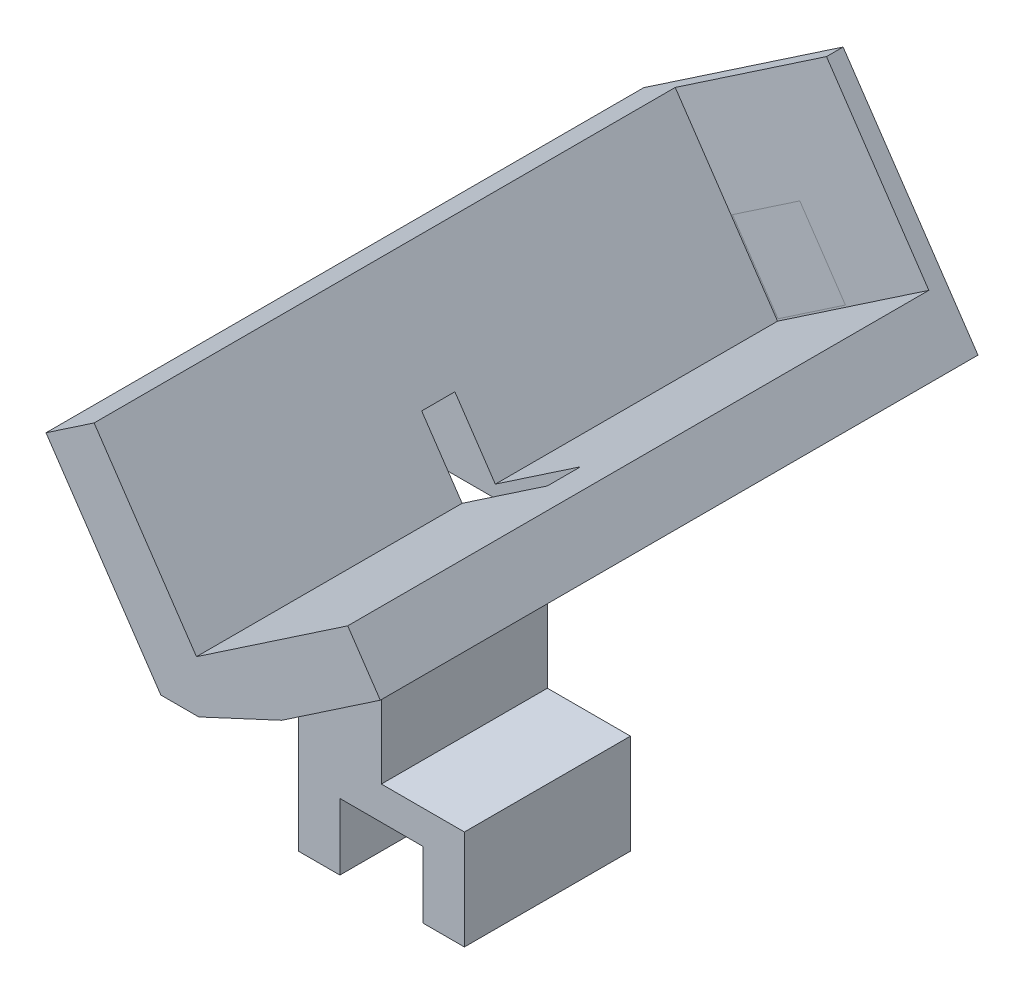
from build123d import *

# Parameters (mm, degrees)
EXTRUDE1_DEPTH      = 10
EXTRUDE2_DEPTH      = 10
EXTRUDE3_DEPTH      = 20
EXTRUDE3_DEPTH_BACK = 16
SKETCH5_W           = 12.517816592
SKETCH5_H           = 10.675390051
EXTRUDE5_DEPTH      = 2
SKETCH6_R           = 0.5
EXTRUDE6_DEPTH      = 1
EXTRUDE7_DEPTH      = 1
SKETCH8_W           = 12.109867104
SKETCH8_H           = 3.741853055
EXTRUDE8_DEPTH      = 33.462726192


with BuildPart() as part:
    # Sketch1 → Extrude1 (new body)
    with BuildSketch(Plane.XY):
        Polygon((0, 0), (5, 0), (5, -4), (7.5, -4), (7.5, 2), (-2.5, 2), (-2.5, -4), (0, -4), align=None)
    extrude(amount=EXTRUDE1_DEPTH)

    # Sketch2 → Extrude2 (add)
    with BuildSketch(Plane.XY.offset(10)):
        Polygon((-2.5, 2), (2.5, 2), (2.5, 8.325412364), (8.434305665, 12.340830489), (6.472876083, 15.239587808), (-2.637504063, 9.075094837), (-8.801997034, 18.185474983), (-11.700754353, 16.224045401), (-4.782705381, 6), (-2.5, 6), align=None)
    extrude(amount=-EXTRUDE2_DEPTH)

    # Sketch3 → Extrude3 (add, two sides: drawn at the far end of the back side and taken through both)
    with BuildSketch(Plane(origin=(0, 0, 0), x_dir=(-1, 0, 0), z_dir=(0, 0, -1)).offset(-EXTRUDE3_DEPTH_BACK)):
        Polygon((-2.5, 8.325412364), (2.5, 6), (4.782705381, 6), (11.700754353, 16.224045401), (8.801997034, 18.185474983), (2.637504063, 9.075094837), (-6.472876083, 15.239587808), (-8.434305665, 12.340830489), align=None)
    extrude(amount=EXTRUDE3_DEPTH + EXTRUDE3_DEPTH_BACK)

    # Sketch5 → Extrude5 (cut)
    with BuildSketch(Plane.XY):
        with Locations((-3.758908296, 7.337695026)):
            Rectangle(SKETCH5_W, SKETCH5_H)
    extrude(amount=-EXTRUDE5_DEPTH, mode=Mode.SUBTRACT)

    # Sketch6 → Extrude6 (add)
    with BuildSketch(Plane(origin=(0, 0, 0), x_dir=(-1, 0, 0), z_dir=(0, 0, -1))):
        Polygon((9.299574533, 12.675390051), (10.956007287, 11.554573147), (9.835190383, 9.898140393), (8.178757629, 11.018957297), align=None)
        with Locations((9.567382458, 11.286765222)):
            Circle(SKETCH6_R, mode=Mode.SUBTRACT)
    extrude(amount=-EXTRUDE6_DEPTH)

    # Sketch7 → Extrude7 (add)
    with BuildSketch(Plane(origin=(0, 0, -20), x_dir=(-1, 0, 0), z_dir=(0, 0, -1))):
        Polygon((2.637504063, 9.075094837), (-6.472876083, 15.239587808), (-0.308383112, 24.349967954), (8.801997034, 18.185474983), align=None)
    extrude(amount=-EXTRUDE7_DEPTH)

    # Sketch8 → Extrude8 (cut, through all)
    with BuildSketch(Plane.XY.offset(-2)):
        with Locations((-3.554933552, 6.454485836)):
            Rectangle(SKETCH8_W, SKETCH8_H)
    extrude(amount=-EXTRUDE8_DEPTH, mode=Mode.SUBTRACT)


solid = part.part
